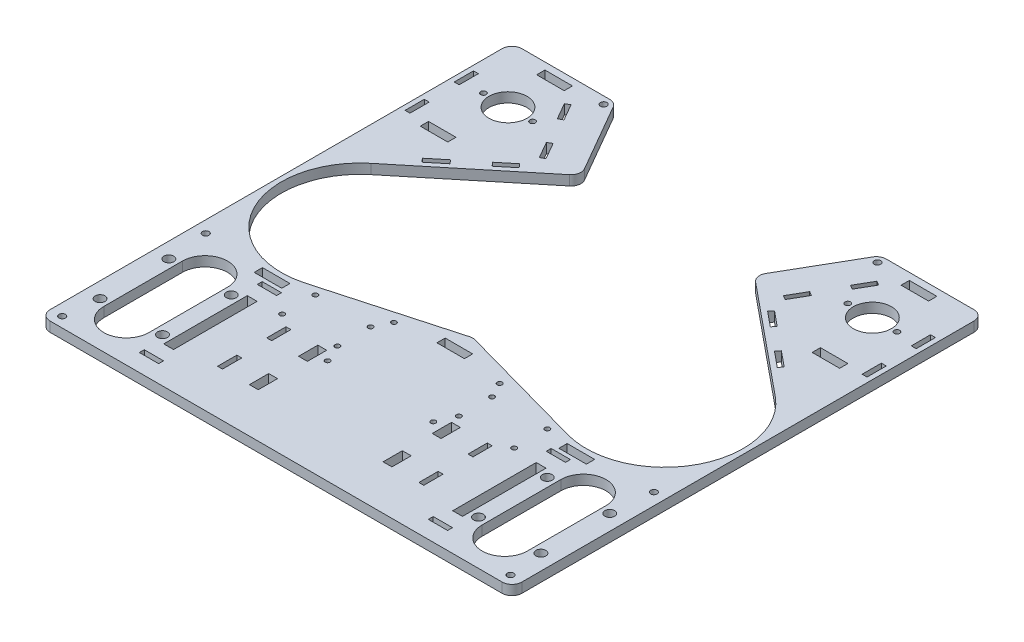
from build123d import *

# Parameters (mm, degrees)
SKETCH1_R      = 1.7859375
SKETCH1_R_2    = 12.303125
SKETCH1_R_3    = 3.175
SKETCH1_R_4    = 2.0955
SKETCH1_R_5    = 1.5875
SKETCH1_W      = 3.175
SKETCH1_H      = 12.446
SKETCH1_W_2    = 5.715
SKETCH1_W_3    = 6.35
SKETCH1_H_2    = 53.975
SKETCH1_W_4    = 17.78
SKETCH1_H_3    = 5.334
SKETCH1_W_5    = 12.446
SKETCH1_H_4    = 3.175
EXTRUDE1_DEPTH = 6.35


with BuildPart() as part:
    # Sketch1 → Extrude1 (new body)
    with BuildSketch(Plane(origin=(0, 0, 0), x_dir=(1, 0, 0), z_dir=(0, 1, 0))):
        with BuildLine():
            Line((-146.05, 0), (146.05, 0))
            ThreePointArc((146.05, 0), (150.540128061, 1.859871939), (152.4, 6.35))
            Line((152.4, 6.35), (152.4, 298.45))
            ThreePointArc((152.4, 298.45), (150.540128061, 302.940128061), (146.05, 304.8))
            Line((146.05, 304.8), (89.36603146, 304.8))
            ThreePointArc((89.36603146, 304.8), (86.19103146, 303.949261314), (83.866770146, 301.625))
            Line((83.866770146, 301.625), (58.575569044, 257.819354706))
            ThreePointArc((58.575569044, 257.819354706), (57.827779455, 253.505559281), (60.04963704, 249.733110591))
            Line((60.04963704, 249.733110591), (130.626546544, 191.889171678))
            ThreePointArc((130.626546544, 191.889171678), (143.510234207, 129.190637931), (84.815355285, 103.656215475))
            Line((84.815355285, 103.656215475), (1.701205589, 126.767875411))
            ThreePointArc((1.701205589, 126.767875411), (0, 127), (-1.701205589, 126.767875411))
            Line((-1.701205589, 126.767875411), (-84.815355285, 103.656215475))
            ThreePointArc((-84.815355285, 103.656215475), (-143.510234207, 129.190637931), (-130.626546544, 191.889171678))
            Line((-130.626546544, 191.889171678), (-60.04963704, 249.733110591))
            ThreePointArc((-60.04963704, 249.733110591), (-57.827779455, 253.505559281), (-58.575569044, 257.819354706))
            Line((-58.575569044, 257.819354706), (-83.866770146, 301.625))
            ThreePointArc((-83.866770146, 301.625), (-86.19103146, 303.949261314), (-89.36603146, 304.8))
            Line((-89.36603146, 304.8), (-146.05, 304.8))
            ThreePointArc((-146.05, 304.8), (-150.540128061, 302.940128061), (-152.4, 298.45))
            Line((-152.4, 298.45), (-152.4, 6.35))
            ThreePointArc((-152.4, 6.35), (-150.540128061, 1.859871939), (-146.05, 0))
        make_face()
        with Locations(Location((-133.58301573, 267.510901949, 0), (0, 0, 270))):
            Circle(SKETCH1_R, mode=Mode.SUBTRACT)
        with Locations(Location((-101.83301573, 267.510901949, 0), (0, 0, 90))):
            Circle(SKETCH1_R, mode=Mode.SUBTRACT)
        with Locations(Location((-117.70801573, 267.510901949, 0), (0, 0, 270))):
            Circle(SKETCH1_R_2, mode=Mode.SUBTRACT)
        with Locations(Location((-142.39875, 73.124609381, 0), (0, 0, 270))):
            Circle(SKETCH1_R_3, mode=Mode.SUBTRACT)
        with Locations(Location((-102.07625, 28.674609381, 0), (0, 0, 270))):
            Circle(SKETCH1_R_3, mode=Mode.SUBTRACT)
        with Locations(Location((-142.39875, 28.674609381, 0), (0, 0, 90))):
            Circle(SKETCH1_R_3, mode=Mode.SUBTRACT)
        with Locations(Location((-102.07625, 73.124609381, 0), (0, 0, 90))):
            Circle(SKETCH1_R_3, mode=Mode.SUBTRACT)
        with Locations(Location((102.07625, 73.124609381, 0), (0, 0, 270))):
            Circle(SKETCH1_R_3, mode=Mode.SUBTRACT)
        with Locations(Location((142.39875, 28.674609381, 0), (0, 0, 270))):
            Circle(SKETCH1_R_3, mode=Mode.SUBTRACT)
        with Locations(Location((102.07625, 28.674609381, 0), (0, 0, 90))):
            Circle(SKETCH1_R_3, mode=Mode.SUBTRACT)
        with Locations(Location((142.39875, 73.124609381, 0), (0, 0, 90))):
            Circle(SKETCH1_R_3, mode=Mode.SUBTRACT)
        with Locations(Location((117.70801573, 267.510901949, 0), (0, 0, 90))):
            Circle(SKETCH1_R_2, mode=Mode.SUBTRACT)
        with Locations(Location((101.83301573, 267.510901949, 0), (0, 0, 270))):
            Circle(SKETCH1_R, mode=Mode.SUBTRACT)
        with Locations(Location((133.58301573, 267.510901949, 0), (0, 0, 90))):
            Circle(SKETCH1_R, mode=Mode.SUBTRACT)
        with Locations(Location((-144.78, 99.314, 0), (0, 0, 270))):
            Circle(SKETCH1_R_4, mode=Mode.SUBTRACT)
        with Locations(Location((-144.78, 6.604, 0), (0, 0, 90))):
            Circle(SKETCH1_R_4, mode=Mode.SUBTRACT)
        with Locations(Location((144.78, 99.314, 0), (0, 0, 90))):
            Circle(SKETCH1_R_4, mode=Mode.SUBTRACT)
        with Locations(Location((144.78, 6.604, 0), (0, 0, 270))):
            Circle(SKETCH1_R_4, mode=Mode.SUBTRACT)
        with Locations(Location((-34.13125, 67.409609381, 0), (0, 0, 270))):
            Circle(SKETCH1_R_5, mode=Mode.SUBTRACT)
        with Locations(Location((34.13125, 67.409609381, 0), (0, 0, 270))):
            Circle(SKETCH1_R_5, mode=Mode.SUBTRACT)
        with Locations(Location((-34.13125, 110.272109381, 0), (0, 0, 270))):
            Circle(SKETCH1_R_5, mode=Mode.SUBTRACT)
        with Locations(Location((34.13125, 110.272109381, 0), (0, 0, 270))):
            Circle(SKETCH1_R_5, mode=Mode.SUBTRACT)
        with Locations(Location((-74.93, 78.839609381, 0), (0, 0, 270))):
            Circle(SKETCH1_R_5, mode=Mode.SUBTRACT)
        with Locations(Location((-39.21125, 78.839609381, 0), (0, 0, 270))):
            Circle(SKETCH1_R_5, mode=Mode.SUBTRACT)
        with Locations(Location((-74.93, 100.270859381, 0), (0, 0, 270))):
            Circle(SKETCH1_R_5, mode=Mode.SUBTRACT)
        with Locations(Location((-39.21125, 100.270859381, 0), (0, 0, 270))):
            Circle(SKETCH1_R_5, mode=Mode.SUBTRACT)
        with Locations(Location((74.93, 78.839609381, 0), (0, 0, 90))):
            Circle(SKETCH1_R_5, mode=Mode.SUBTRACT)
        with Locations(Location((39.21125, 78.839609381, 0), (0, 0, 90))):
            Circle(SKETCH1_R_5, mode=Mode.SUBTRACT)
        with Locations(Location((39.21125, 100.270859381, 0), (0, 0, 90))):
            Circle(SKETCH1_R_5, mode=Mode.SUBTRACT)
        with Locations(Location((74.93, 100.270859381, 0), (0, 0, 90))):
            Circle(SKETCH1_R_5, mode=Mode.SUBTRACT)
        with Locations(Location((-88.449487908, 300.0375, 0), (0, 0, 270))):
            Circle(SKETCH1_R_4, mode=Mode.SUBTRACT)
        with Locations(Location((88.449487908, 300.0375, 0), (0, 0, 90))):
            Circle(SKETCH1_R_4, mode=Mode.SUBTRACT)
        with BuildLine():
            Line((-136.8425, 76.299609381), (-136.8425, 25.499609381))
            ThreePointArc((-136.8425, 25.499609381), (-122.2375, 10.894609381), (-107.6325, 25.499609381))
            Line((-107.6325, 25.499609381), (-107.6325, 76.299609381))
            ThreePointArc((-107.6325, 76.299609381), (-122.2375, 90.904609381), (-136.8425, 76.299609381))
        make_face(mode=Mode.SUBTRACT)
        with Locations((-65.025, 66.774609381)):
            Rectangle(SKETCH1_W, SKETCH1_H, mode=Mode.SUBTRACT)
        with Locations((-43.18, 66.774609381)):
            Rectangle(SKETCH1_W_2, SKETCH1_H, mode=Mode.SUBTRACT)
        with Locations((-43.18, 35.024609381)):
            Rectangle(SKETCH1_W_2, SKETCH1_H, mode=Mode.SUBTRACT)
        with Locations((93.345, 50.899609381)):
            Rectangle(SKETCH1_W_3, SKETCH1_H_2, mode=Mode.SUBTRACT)
        with Locations((-93.345, 50.899609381)):
            Rectangle(SKETCH1_W_3, SKETCH1_H_2, mode=Mode.SUBTRACT)
        with Locations((-147.6375, 270.519354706)):
            Rectangle(SKETCH1_W, SKETCH1_H, mode=Mode.SUBTRACT)
        with BuildLine():
            Line((107.6325, 76.299609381), (107.6325, 25.499609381))
            ThreePointArc((107.6325, 25.499609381), (122.2375, 10.894609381), (136.8425, 25.499609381))
            Line((136.8425, 25.499609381), (136.8425, 76.299609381))
            ThreePointArc((136.8425, 76.299609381), (122.2375, 90.904609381), (107.6325, 76.299609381))
        make_face(mode=Mode.SUBTRACT)
        with Locations((117.70801573, 297.607193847)):
            Rectangle(SKETCH1_W_4, SKETCH1_H_3, mode=Mode.SUBTRACT)
        with Locations((-65.025, 35.024609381)):
            Rectangle(SKETCH1_W, SKETCH1_H, mode=Mode.SUBTRACT)
        with Locations((65.025, 35.024609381)):
            Rectangle(SKETCH1_W, SKETCH1_H, mode=Mode.SUBTRACT)
        with Locations((-147.6375, 238.769354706)):
            Rectangle(SKETCH1_W, SKETCH1_H, mode=Mode.SUBTRACT)
        with Locations((43.18, 35.024609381)):
            Rectangle(SKETCH1_W_2, SKETCH1_H, mode=Mode.SUBTRACT)
        with Locations((43.18, 66.774609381)):
            Rectangle(SKETCH1_W_2, SKETCH1_H, mode=Mode.SUBTRACT)
        with Locations((65.025, 66.774609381)):
            Rectangle(SKETCH1_W, SKETCH1_H, mode=Mode.SUBTRACT)
        with Locations((-117.70801573, 297.607193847)):
            Rectangle(SKETCH1_W_4, SKETCH1_H_3, mode=Mode.SUBTRACT)
        Polygon((-101.517584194, 287.747106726), (-98.767953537, 289.334606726), (-92.544953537, 278.55605455), (-95.294584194, 276.96855455), align=None, mode=Mode.SUBTRACT)
        Polygon((-76.669953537, 251.05974798), (-82.892953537, 261.838300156), (-85.642584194, 260.250800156), (-79.419584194, 249.47224798), align=None, mode=Mode.SUBTRACT)
        Polygon((-82.272155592, 239.730057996), (-80.259558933, 237.274435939), (-89.885597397, 229.385057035), (-91.898194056, 231.840679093), align=None, mode=Mode.SUBTRACT)
        Polygon((-114.834717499, 208.93707498), (-104.815779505, 217.148469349), (-106.828376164, 219.604091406), (-116.847314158, 211.392697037), align=None, mode=Mode.SUBTRACT)
        Polygon((91.898194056, 231.840679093), (89.885597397, 229.385057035), (80.259558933, 237.274435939), (82.272155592, 239.730057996), align=None, mode=Mode.SUBTRACT)
        Polygon((116.847314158, 211.392697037), (114.834717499, 208.93707498), (104.815779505, 217.148469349), (106.828376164, 219.604091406), align=None, mode=Mode.SUBTRACT)
        Polygon((79.419584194, 249.47224798), (76.669953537, 251.05974798), (82.892953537, 261.838300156), (85.642584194, 260.250800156), align=None, mode=Mode.SUBTRACT)
        Polygon((98.767953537, 289.334606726), (92.544953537, 278.55605455), (95.294584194, 276.96855455), (101.517584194, 287.747106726), align=None, mode=Mode.SUBTRACT)
        with Locations((147.6375, 238.769354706)):
            Rectangle(SKETCH1_W, SKETCH1_H, mode=Mode.SUBTRACT)
        with Locations((147.6375, 270.519354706)):
            Rectangle(SKETCH1_W, SKETCH1_H, mode=Mode.SUBTRACT)
        with Locations((-93.345, 88.999609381)):
            Rectangle(SKETCH1_W_5, SKETCH1_H_4, mode=Mode.SUBTRACT)
        with Locations((-93.345, 12.799609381)):
            Rectangle(SKETCH1_W_5, SKETCH1_H_4, mode=Mode.SUBTRACT)
        with Locations((93.345, 12.799609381)):
            Rectangle(SKETCH1_W_5, SKETCH1_H_4, mode=Mode.SUBTRACT)
        with Locations((93.345, 88.999609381)):
            Rectangle(SKETCH1_W_5, SKETCH1_H_4, mode=Mode.SUBTRACT)
        with Locations((-126.59801573, 231.267)):
            Rectangle(SKETCH1_W_4, SKETCH1_H_3, mode=Mode.SUBTRACT)
        with Locations((-98.425, 95.830218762)):
            Rectangle(SKETCH1_W_4, SKETCH1_H_3, mode=Mode.SUBTRACT)
        with Locations((0, 115.443)):
            Rectangle(SKETCH1_W_4, SKETCH1_H_3, mode=Mode.SUBTRACT)
        with Locations((126.59801573, 231.267)):
            Rectangle(SKETCH1_W_4, SKETCH1_H_3, mode=Mode.SUBTRACT)
        with Locations((98.425, 95.830218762)):
            Rectangle(SKETCH1_W_4, SKETCH1_H_3, mode=Mode.SUBTRACT)
    extrude(amount=EXTRUDE1_DEPTH)


solid = part.part
